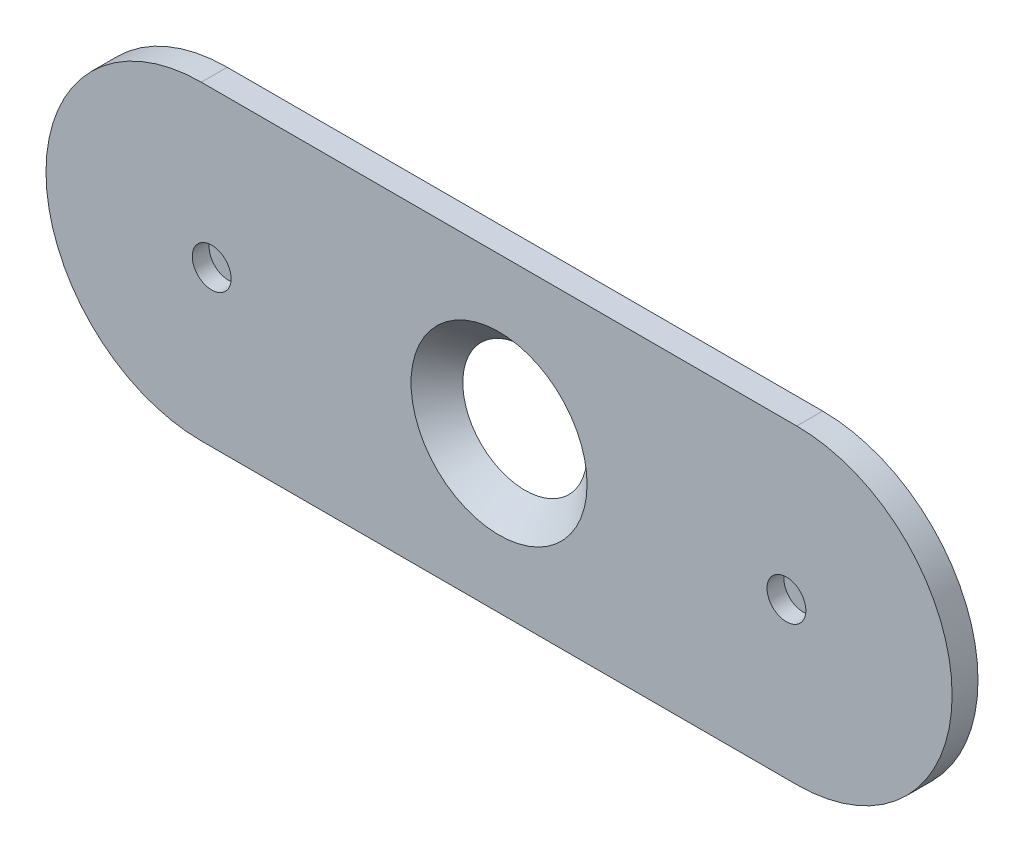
ISO-10303-21;
HEADER;
FILE_DESCRIPTION(('STEP AP214'),'2;1');
FILE_NAME('part.step','',(''),(''),'','','');
FILE_SCHEMA(('AUTOMOTIVE_DESIGN { 1 0 10303 214 1 1 1 1 }'));
ENDSEC;
DATA;
#1=APPLICATION_CONTEXT('core data for automotive mechanical design processes');
#2=APPLICATION_PROTOCOL_DEFINITION('international standard','automotive_design',2000,#1);
#3=PRODUCT_CONTEXT('',#1,'mechanical');
#4=PRODUCT('Part','Part','',(#3));
#5=PRODUCT_RELATED_PRODUCT_CATEGORY('part','',(#4));
#6=PRODUCT_DEFINITION_FORMATION('','',#4);
#7=PRODUCT_DEFINITION_CONTEXT('part definition',#1,'design');
#8=PRODUCT_DEFINITION('design','',#6,#7);
#9=PRODUCT_DEFINITION_SHAPE('','',#8);
#10=(LENGTH_UNIT() NAMED_UNIT(*) SI_UNIT(.MILLI.,.METRE.));
#11=(NAMED_UNIT(*) PLANE_ANGLE_UNIT() SI_UNIT($,.RADIAN.));
#12=(NAMED_UNIT(*) SI_UNIT($,.STERADIAN.) SOLID_ANGLE_UNIT());
#13=UNCERTAINTY_MEASURE_WITH_UNIT(LENGTH_MEASURE(1.E-05),#10,'distance_accuracy_value','');
#14=(GEOMETRIC_REPRESENTATION_CONTEXT(3) GLOBAL_UNCERTAINTY_ASSIGNED_CONTEXT((#13)) GLOBAL_UNIT_ASSIGNED_CONTEXT((#10,
#11,#12)) REPRESENTATION_CONTEXT('',''));
#15=CARTESIAN_POINT('',(0.,0.,0.));
#16=DIRECTION('',(0.,0.,1.));
#17=DIRECTION('',(1.,0.,0.));
#18=AXIS2_PLACEMENT_3D('',#15,#16,#17);
#19=CARTESIAN_POINT('',(11.1,0.,0.35));
#20=DIRECTION('',(0.,0.,-1.));
#21=DIRECTION('',(-1.,0.,0.));
#22=AXIS2_PLACEMENT_3D('',#19,#20,#21);
#23=PLANE('',#22);
#24=CARTESIAN_POINT('',(11.1,0.,0.35));
#25=DIRECTION('',(0.,0.,-1.));
#26=DIRECTION('',(-1.,0.,0.));
#27=AXIS2_PLACEMENT_3D('',#24,#25,#26);
#28=CIRCLE('',#27,0.75);
#29=CARTESIAN_POINT('',(10.35,0.,0.35));
#30=VERTEX_POINT('',#29);
#31=EDGE_CURVE('E19',#30,#30,#28,.F.);
#32=ORIENTED_EDGE('',*,*,#31,.T.);
#33=EDGE_LOOP('',(#32));
#34=FACE_BOUND('',#33,.T.);
#35=ADVANCED_FACE('F15',(#34),#23,.F.);
#36=CARTESIAN_POINT('',(-11.1,0.,0.35));
#37=DIRECTION('',(0.,0.,-1.));
#38=DIRECTION('',(-1.,0.,0.));
#39=AXIS2_PLACEMENT_3D('',#36,#37,#38);
#40=PLANE('',#39);
#41=CARTESIAN_POINT('',(-11.1,0.,0.35));
#42=DIRECTION('',(0.,0.,-1.));
#43=DIRECTION('',(-1.,0.,0.));
#44=AXIS2_PLACEMENT_3D('',#41,#42,#43);
#45=CIRCLE('',#44,0.75);
#46=CARTESIAN_POINT('',(-11.85,0.,0.35));
#47=VERTEX_POINT('',#46);
#48=EDGE_CURVE('E87',#47,#47,#45,.F.);
#49=ORIENTED_EDGE('',*,*,#48,.T.);
#50=EDGE_LOOP('',(#49));
#51=FACE_BOUND('',#50,.T.);
#52=ADVANCED_FACE('F98',(#51),#40,.F.);
#53=CARTESIAN_POINT('',(11.1,0.,1.));
#54=DIRECTION('',(0.,0.,-1.));
#55=DIRECTION('',(-1.,0.,0.));
#56=AXIS2_PLACEMENT_3D('',#53,#54,#55);
#57=CYLINDRICAL_SURFACE('',#56,0.75);
#58=CARTESIAN_POINT('',(11.1,0.,1.));
#59=DIRECTION('',(0.,0.,-1.));
#60=DIRECTION('',(-1.,0.,0.));
#61=AXIS2_PLACEMENT_3D('',#58,#59,#60);
#62=CIRCLE('',#61,0.75);
#63=CARTESIAN_POINT('',(10.35,0.,1.));
#64=VERTEX_POINT('',#63);
#65=EDGE_CURVE('E85',#64,#64,#62,.T.);
#66=ORIENTED_EDGE('',*,*,#65,.F.);
#67=EDGE_LOOP('',(#66));
#68=FACE_BOUND('',#67,.T.);
#69=ORIENTED_EDGE('',*,*,#31,.F.);
#70=EDGE_LOOP('',(#69));
#71=FACE_BOUND('',#70,.T.);
#72=ADVANCED_FACE('F95',(#68,#71),#57,.F.);
#73=CARTESIAN_POINT('',(-11.1,0.,1.));
#74=DIRECTION('',(0.,0.,-1.));
#75=DIRECTION('',(-1.,0.,0.));
#76=AXIS2_PLACEMENT_3D('',#73,#74,#75);
#77=CYLINDRICAL_SURFACE('',#76,0.75);
#78=CARTESIAN_POINT('',(-11.1,0.,1.));
#79=DIRECTION('',(0.,0.,-1.));
#80=DIRECTION('',(-1.,0.,0.));
#81=AXIS2_PLACEMENT_3D('',#78,#79,#80);
#82=CIRCLE('',#81,0.75);
#83=CARTESIAN_POINT('',(-11.85,0.,1.));
#84=VERTEX_POINT('',#83);
#85=EDGE_CURVE('E64',#84,#84,#82,.T.);
#86=ORIENTED_EDGE('',*,*,#85,.F.);
#87=EDGE_LOOP('',(#86));
#88=FACE_BOUND('',#87,.T.);
#89=ORIENTED_EDGE('',*,*,#48,.F.);
#90=EDGE_LOOP('',(#89));
#91=FACE_BOUND('',#90,.T.);
#92=ADVANCED_FACE('F97',(#88,#91),#77,.F.);
#93=CARTESIAN_POINT('',(11.1,0.,-0.65));
#94=DIRECTION('',(0.,0.,1.));
#95=DIRECTION('',(1.,0.,0.));
#96=AXIS2_PLACEMENT_3D('',#93,#94,#95);
#97=PLANE('',#96);
#98=CARTESIAN_POINT('',(11.1,0.,-0.65));
#99=DIRECTION('',(0.,0.,-1.));
#100=DIRECTION('',(-1.,0.,0.));
#101=AXIS2_PLACEMENT_3D('',#98,#99,#100);
#102=CIRCLE('',#101,0.75);
#103=CARTESIAN_POINT('',(10.35,0.,-0.65));
#104=VERTEX_POINT('',#103);
#105=EDGE_CURVE('E251',#104,#104,#102,.F.);
#106=ORIENTED_EDGE('',*,*,#105,.F.);
#107=EDGE_LOOP('',(#106));
#108=FACE_BOUND('',#107,.T.);
#109=ADVANCED_FACE('F106',(#108),#97,.F.);
#110=CARTESIAN_POINT('',(-11.1,0.,-0.65));
#111=DIRECTION('',(0.,0.,1.));
#112=DIRECTION('',(1.,0.,0.));
#113=AXIS2_PLACEMENT_3D('',#110,#111,#112);
#114=PLANE('',#113);
#115=CARTESIAN_POINT('',(-11.1,0.,-0.65));
#116=DIRECTION('',(0.,0.,-1.));
#117=DIRECTION('',(-1.,0.,0.));
#118=AXIS2_PLACEMENT_3D('',#115,#116,#117);
#119=CIRCLE('',#118,0.75);
#120=CARTESIAN_POINT('',(-11.85,0.,-0.65));
#121=VERTEX_POINT('',#120);
#122=EDGE_CURVE('E258',#121,#121,#119,.F.);
#123=ORIENTED_EDGE('',*,*,#122,.F.);
#124=EDGE_LOOP('',(#123));
#125=FACE_BOUND('',#124,.T.);
#126=ADVANCED_FACE('F142',(#125),#114,.F.);
#127=CARTESIAN_POINT('',(0.,0.,1.));
#128=DIRECTION('',(0.,0.,1.));
#129=DIRECTION('',(1.,0.,0.));
#130=AXIS2_PLACEMENT_3D('',#127,#128,#129);
#131=PLANE('',#130);
#132=CARTESIAN_POINT('',(0.,0.,1.));
#133=DIRECTION('',(0.,0.,1.));
#134=DIRECTION('',(1.,0.,0.));
#135=AXIS2_PLACEMENT_3D('',#132,#133,#134);
#136=CIRCLE('',#135,3.4);
#137=CARTESIAN_POINT('',(3.4,0.,1.));
#138=VERTEX_POINT('',#137);
#139=EDGE_CURVE('E247',#138,#138,#136,.F.);
#140=ORIENTED_EDGE('',*,*,#139,.T.);
#141=EDGE_LOOP('',(#140));
#142=FACE_BOUND('',#141,.T.);
#143=ORIENTED_EDGE('',*,*,#85,.T.);
#144=EDGE_LOOP('',(#143));
#145=FACE_BOUND('',#144,.T.);
#146=ORIENTED_EDGE('',*,*,#65,.T.);
#147=EDGE_LOOP('',(#146));
#148=FACE_BOUND('',#147,.T.);
#149=DIRECTION('',(1.,0.,0.));
#150=VECTOR('',#149,1.);
#151=CARTESIAN_POINT('',(11.5,-6.,1.));
#152=LINE('',#151,#150);
#153=CARTESIAN_POINT('',(11.5,-6.,1.));
#154=VERTEX_POINT('',#153);
#155=CARTESIAN_POINT('',(-11.5,-6.,1.));
#156=VERTEX_POINT('',#155);
#157=EDGE_CURVE('E58',#154,#156,#152,.F.);
#158=ORIENTED_EDGE('',*,*,#157,.F.);
#159=CARTESIAN_POINT('',(11.5,0.,1.));
#160=DIRECTION('',(0.,0.,1.));
#161=DIRECTION('',(1.,0.,0.));
#162=AXIS2_PLACEMENT_3D('',#159,#160,#161);
#163=CIRCLE('',#162,6.);
#164=CARTESIAN_POINT('',(11.5,6.,1.));
#165=VERTEX_POINT('',#164);
#166=EDGE_CURVE('E55',#165,#154,#163,.F.);
#167=ORIENTED_EDGE('',*,*,#166,.F.);
#168=DIRECTION('',(1.,0.,0.));
#169=VECTOR('',#168,1.);
#170=CARTESIAN_POINT('',(-11.5,6.,1.));
#171=LINE('',#170,#169);
#172=CARTESIAN_POINT('',(-11.5,6.,1.));
#173=VERTEX_POINT('',#172);
#174=EDGE_CURVE('E74',#173,#165,#171,.T.);
#175=ORIENTED_EDGE('',*,*,#174,.F.);
#176=CARTESIAN_POINT('',(-11.5,0.,1.));
#177=DIRECTION('',(0.,0.,1.));
#178=DIRECTION('',(1.,0.,0.));
#179=AXIS2_PLACEMENT_3D('',#176,#177,#178);
#180=CIRCLE('',#179,6.);
#181=EDGE_CURVE('E61',#156,#173,#180,.F.);
#182=ORIENTED_EDGE('',*,*,#181,.F.);
#183=EDGE_LOOP('',(#158,#167,#175,#182));
#184=FACE_BOUND('',#183,.T.);
#185=ADVANCED_FACE('F60',(#142,#145,#148,#184),#131,.T.);
#186=CARTESIAN_POINT('',(11.5,-6.,0.));
#187=DIRECTION('',(0.,-1.,0.));
#188=DIRECTION('',(0.,0.,-1.));
#189=AXIS2_PLACEMENT_3D('',#186,#187,#188);
#190=PLANE('',#189);
#191=DIRECTION('',(1.,0.,0.));
#192=VECTOR('',#191,1.);
#193=CARTESIAN_POINT('',(0.,-6.,0.));
#194=LINE('',#193,#192);
#195=CARTESIAN_POINT('',(-11.5,-6.,0.));
#196=VERTEX_POINT('',#195);
#197=CARTESIAN_POINT('',(11.5,-6.,0.));
#198=VERTEX_POINT('',#197);
#199=EDGE_CURVE('E70',#196,#198,#194,.T.);
#200=ORIENTED_EDGE('',*,*,#199,.T.);
#201=DIRECTION('',(0.,0.,1.));
#202=VECTOR('',#201,1.);
#203=CARTESIAN_POINT('',(11.5,-6.,0.));
#204=LINE('',#203,#202);
#205=EDGE_CURVE('E67',#154,#198,#204,.F.);
#206=ORIENTED_EDGE('',*,*,#205,.F.);
#207=ORIENTED_EDGE('',*,*,#157,.T.);
#208=DIRECTION('',(0.,0.,1.));
#209=VECTOR('',#208,1.);
#210=CARTESIAN_POINT('',(-11.5,-6.,0.));
#211=LINE('',#210,#209);
#212=EDGE_CURVE('E249',#196,#156,#211,.T.);
#213=ORIENTED_EDGE('',*,*,#212,.F.);
#214=EDGE_LOOP('',(#200,#206,#207,#213));
#215=FACE_BOUND('',#214,.T.);
#216=ADVANCED_FACE('F68',(#215),#190,.T.);
#217=CARTESIAN_POINT('',(11.5,0.,0.));
#218=DIRECTION('',(0.,0.,1.));
#219=DIRECTION('',(1.,0.,0.));
#220=AXIS2_PLACEMENT_3D('',#217,#218,#219);
#221=CYLINDRICAL_SURFACE('',#220,6.);
#222=CARTESIAN_POINT('',(11.5,0.,0.));
#223=DIRECTION('',(0.,0.,1.));
#224=DIRECTION('',(1.,0.,0.));
#225=AXIS2_PLACEMENT_3D('',#222,#223,#224);
#226=CIRCLE('',#225,6.);
#227=CARTESIAN_POINT('',(11.5,6.,0.));
#228=VERTEX_POINT('',#227);
#229=EDGE_CURVE('E240',#198,#228,#226,.T.);
#230=ORIENTED_EDGE('',*,*,#229,.T.);
#231=DIRECTION('',(0.,0.,1.));
#232=VECTOR('',#231,1.);
#233=CARTESIAN_POINT('',(11.5,6.,0.));
#234=LINE('',#233,#232);
#235=EDGE_CURVE('E77',#165,#228,#234,.F.);
#236=ORIENTED_EDGE('',*,*,#235,.F.);
#237=ORIENTED_EDGE('',*,*,#166,.T.);
#238=ORIENTED_EDGE('',*,*,#205,.T.);
#239=EDGE_LOOP('',(#230,#236,#237,#238));
#240=FACE_BOUND('',#239,.T.);
#241=ADVANCED_FACE('F76',(#240),#221,.T.);
#242=CARTESIAN_POINT('',(-11.5,6.,0.));
#243=DIRECTION('',(0.,1.,0.));
#244=DIRECTION('',(0.,0.,1.));
#245=AXIS2_PLACEMENT_3D('',#242,#243,#244);
#246=PLANE('',#245);
#247=DIRECTION('',(1.,0.,0.));
#248=VECTOR('',#247,1.);
#249=CARTESIAN_POINT('',(0.,6.,0.));
#250=LINE('',#249,#248);
#251=CARTESIAN_POINT('',(-11.5,6.,0.));
#252=VERTEX_POINT('',#251);
#253=EDGE_CURVE('E239',#228,#252,#250,.F.);
#254=ORIENTED_EDGE('',*,*,#253,.T.);
#255=DIRECTION('',(0.,0.,1.));
#256=VECTOR('',#255,1.);
#257=CARTESIAN_POINT('',(-11.5,6.,0.));
#258=LINE('',#257,#256);
#259=EDGE_CURVE('E34',#173,#252,#258,.F.);
#260=ORIENTED_EDGE('',*,*,#259,.F.);
#261=ORIENTED_EDGE('',*,*,#174,.T.);
#262=ORIENTED_EDGE('',*,*,#235,.T.);
#263=EDGE_LOOP('',(#254,#260,#261,#262));
#264=FACE_BOUND('',#263,.T.);
#265=ADVANCED_FACE('F174',(#264),#246,.T.);
#266=CARTESIAN_POINT('',(-11.5,0.,0.));
#267=DIRECTION('',(0.,0.,1.));
#268=DIRECTION('',(1.,0.,0.));
#269=AXIS2_PLACEMENT_3D('',#266,#267,#268);
#270=CYLINDRICAL_SURFACE('',#269,6.);
#271=CARTESIAN_POINT('',(-11.5,0.,0.));
#272=DIRECTION('',(0.,0.,1.));
#273=DIRECTION('',(1.,0.,0.));
#274=AXIS2_PLACEMENT_3D('',#271,#272,#273);
#275=CIRCLE('',#274,6.);
#276=EDGE_CURVE('E241',#252,#196,#275,.T.);
#277=ORIENTED_EDGE('',*,*,#276,.T.);
#278=ORIENTED_EDGE('',*,*,#212,.T.);
#279=ORIENTED_EDGE('',*,*,#181,.T.);
#280=ORIENTED_EDGE('',*,*,#259,.T.);
#281=EDGE_LOOP('',(#277,#278,#279,#280));
#282=FACE_BOUND('',#281,.T.);
#283=ADVANCED_FACE('F182',(#282),#270,.T.);
#284=CARTESIAN_POINT('',(11.1,0.,0.));
#285=DIRECTION('',(0.,0.,-1.));
#286=DIRECTION('',(-1.,0.,0.));
#287=AXIS2_PLACEMENT_3D('',#284,#285,#286);
#288=CYLINDRICAL_SURFACE('',#287,0.75);
#289=CARTESIAN_POINT('',(11.1,0.,0.));
#290=DIRECTION('',(0.,0.,-1.));
#291=DIRECTION('',(-1.,0.,0.));
#292=AXIS2_PLACEMENT_3D('',#289,#290,#291);
#293=CIRCLE('',#292,0.75);
#294=CARTESIAN_POINT('',(10.35,0.,0.));
#295=VERTEX_POINT('',#294);
#296=EDGE_CURVE('E236',#295,#295,#293,.T.);
#297=ORIENTED_EDGE('',*,*,#296,.T.);
#298=EDGE_LOOP('',(#297));
#299=FACE_BOUND('',#298,.T.);
#300=ORIENTED_EDGE('',*,*,#105,.T.);
#301=EDGE_LOOP('',(#300));
#302=FACE_BOUND('',#301,.T.);
#303=ADVANCED_FACE('F191',(#299,#302),#288,.T.);
#304=CARTESIAN_POINT('',(-11.1,0.,0.));
#305=DIRECTION('',(0.,0.,-1.));
#306=DIRECTION('',(-1.,0.,0.));
#307=AXIS2_PLACEMENT_3D('',#304,#305,#306);
#308=CYLINDRICAL_SURFACE('',#307,0.75);
#309=CARTESIAN_POINT('',(-11.1,0.,0.));
#310=DIRECTION('',(0.,0.,-1.));
#311=DIRECTION('',(-1.,0.,0.));
#312=AXIS2_PLACEMENT_3D('',#309,#310,#311);
#313=CIRCLE('',#312,0.75);
#314=CARTESIAN_POINT('',(-11.85,0.,0.));
#315=VERTEX_POINT('',#314);
#316=EDGE_CURVE('E25',#315,#315,#313,.T.);
#317=ORIENTED_EDGE('',*,*,#316,.T.);
#318=EDGE_LOOP('',(#317));
#319=FACE_BOUND('',#318,.T.);
#320=ORIENTED_EDGE('',*,*,#122,.T.);
#321=EDGE_LOOP('',(#320));
#322=FACE_BOUND('',#321,.T.);
#323=ADVANCED_FACE('F199',(#319,#322),#308,.T.);
#324=CARTESIAN_POINT('',(0.,0.,1.));
#325=DIRECTION('',(0.,0.,1.));
#326=DIRECTION('',(1.,0.,0.));
#327=AXIS2_PLACEMENT_3D('',#324,#325,#326);
#328=CONICAL_SURFACE('',#327,3.4,0.785398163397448);
#329=ORIENTED_EDGE('',*,*,#139,.F.);
#330=EDGE_LOOP('',(#329));
#331=FACE_BOUND('',#330,.T.);
#332=CARTESIAN_POINT('',(0.,0.,0.));
#333=DIRECTION('',(0.,0.,1.));
#334=DIRECTION('',(1.,0.,0.));
#335=AXIS2_PLACEMENT_3D('',#332,#333,#334);
#336=CIRCLE('',#335,2.4);
#337=CARTESIAN_POINT('',(2.4,0.,0.));
#338=VERTEX_POINT('',#337);
#339=EDGE_CURVE('E10',#338,#338,#336,.F.);
#340=ORIENTED_EDGE('',*,*,#339,.T.);
#341=EDGE_LOOP('',(#340));
#342=FACE_BOUND('',#341,.T.);
#343=ADVANCED_FACE('F17',(#331,#342),#328,.F.);
#344=CARTESIAN_POINT('',(0.,0.,0.));
#345=DIRECTION('',(0.,0.,1.));
#346=DIRECTION('',(1.,0.,0.));
#347=AXIS2_PLACEMENT_3D('',#344,#345,#346);
#348=PLANE('',#347);
#349=ORIENTED_EDGE('',*,*,#339,.F.);
#350=EDGE_LOOP('',(#349));
#351=FACE_BOUND('',#350,.T.);
#352=ORIENTED_EDGE('',*,*,#316,.F.);
#353=EDGE_LOOP('',(#352));
#354=FACE_BOUND('',#353,.T.);
#355=ORIENTED_EDGE('',*,*,#296,.F.);
#356=EDGE_LOOP('',(#355));
#357=FACE_BOUND('',#356,.T.);
#358=ORIENTED_EDGE('',*,*,#253,.F.);
#359=ORIENTED_EDGE('',*,*,#229,.F.);
#360=ORIENTED_EDGE('',*,*,#199,.F.);
#361=ORIENTED_EDGE('',*,*,#276,.F.);
#362=EDGE_LOOP('',(#358,#359,#360,#361));
#363=FACE_BOUND('',#362,.T.);
#364=ADVANCED_FACE('F216',(#351,#354,#357,#363),#348,.F.);
#365=CLOSED_SHELL('',(#35,#52,#72,#92,#109,#126,#185,#216,#241,#265,#283,#303,#323,#343,#364));
#366=MANIFOLD_SOLID_BREP('B1',#365);
#367=ADVANCED_BREP_SHAPE_REPRESENTATION('',(#18,#366),#14);
#368=SHAPE_DEFINITION_REPRESENTATION(#9,#367);
ENDSEC;
END-ISO-10303-21;
